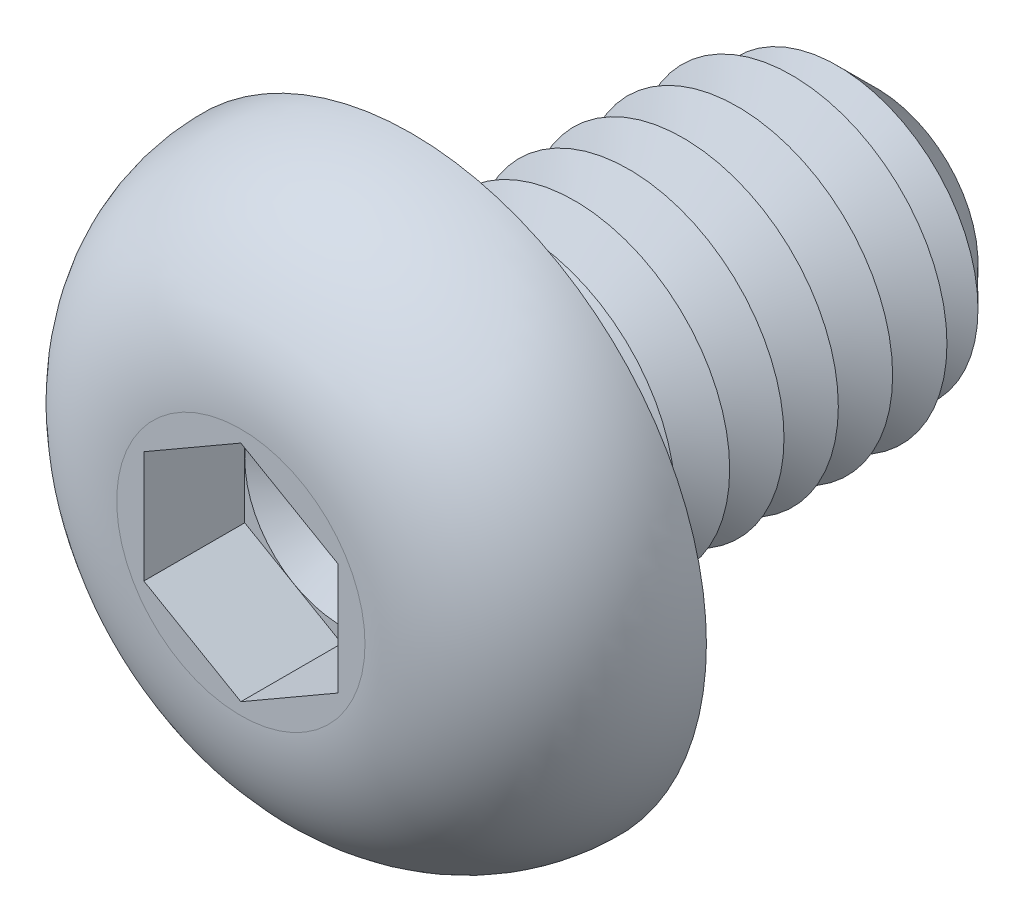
from build123d import *

# Parameters (mm, degrees)
CUT_EXTRUDE1_DEPTH  = 1.3
SKETCH4_R           = 2
BOSS_EXTRUDE1_DEPTH = 6
CHAMFER1_SIZE       = 0.7
LPATTERN1_COUNT     = 7
LPATTERN1_PITCH     = 0.7
FILLET2_R           = 0.3


with BuildPart() as part:
    # Sketch2 → Revolve1 (revolve)
    with BuildSketch(Plane(origin=(0, 0, 0), x_dir=(0, 0, -1), z_dir=(1, 0, 0)), mode=Mode.PRIVATE) as revolve1_sk:
        with BuildLine():
            Line((0, 0), (-2.2, 0))
            Line((-2.2, 0), (-2.2, 1.6))
            ThreePointArc((-2.2, 1.6), (-1.555634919, 3.155634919), (0, 3.8))
            Line((0, 3.8), (0, 0))
        make_face()
    revolve(revolve1_sk.sketch.rotate(Axis((0, 0, 47.934239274), (0, 0, -1)), 90), axis=Axis((0, 0, 47.934239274), (0, 0, -1)))

    # Sketch3 → Cut-Extrude1 (cut)
    with BuildSketch(Plane.XY.offset(2.2)):
        Polygon((0, 1.443375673), (-1.25, 0.721687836), (-1.25, -0.721687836), (0, -1.443375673), (1.25, -0.721687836), (1.25, 0.721687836), align=None)
    extrude(amount=-CUT_EXTRUDE1_DEPTH, mode=Mode.SUBTRACT)

    # Sketch4 → Boss-Extrude1 (add)
    with BuildSketch(Plane(origin=(0, 0, 0), x_dir=(-1, 0, 0), z_dir=(0, 0, -1))):
        with Locations(Location((0, 0, 0), (0, 0, 180))):
            Circle(SKETCH4_R)
    extrude(amount=BOSS_EXTRUDE1_DEPTH)

    # Chamfer1
    chamfer1_edges = [part.edges().sort_by_distance(p)[0] for p in [
        (-2, 0, -6),
    ]]
    chamfer(chamfer1_edges, length=CHAMFER1_SIZE)

    # Sketch5 → Cut-Revolve1 (revolve, cut)
    with BuildSketch(Plane(origin=(0, 0, 0), x_dir=(0, 0, -1), z_dir=(1, 0, 0)), mode=Mode.PRIVATE) as cut_revolve1_sk:
        Polygon((0.7, 2), (1.4, 2), (1.05, 1.393782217), align=None)
    cut_revolve1 = revolve(cut_revolve1_sk.sketch.rotate(Axis((0, 0, 47.934239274), (0, 0, -1)), 90), axis=Axis((0, 0, 47.934239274), (0, 0, -1)), mode=Mode.SUBTRACT)

    # LPattern1: Cut-Revolve1 ×7
    with Locations(*[(0, 0, -i * LPATTERN1_PITCH) for i in range(1, LPATTERN1_COUNT)]):
        add(cut_revolve1, mode=Mode.SUBTRACT)

    # Fillet2
    fillet2_edges = [part.edges().sort_by_distance(p)[0] for p in [
        (-2, 0, 0),
    ]]
    fillet(fillet2_edges, radius=FILLET2_R)

    # Cut-Extrude2 cone 1 section (on through the dimple's axis) → Cut-Extrude2 (revolve, cut)
    with BuildSketch(Plane(origin=(0, 0, 0.9), x_dir=(0, -1, 0), z_dir=(1, 0, 0))):
        Polygon((0, 0), (1.25, 0), (0, 0.721687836), align=None)
    revolve(axis=Axis((0, 0, 0.9), (0, 0, -1)), mode=Mode.SUBTRACT)


solid = part.part
